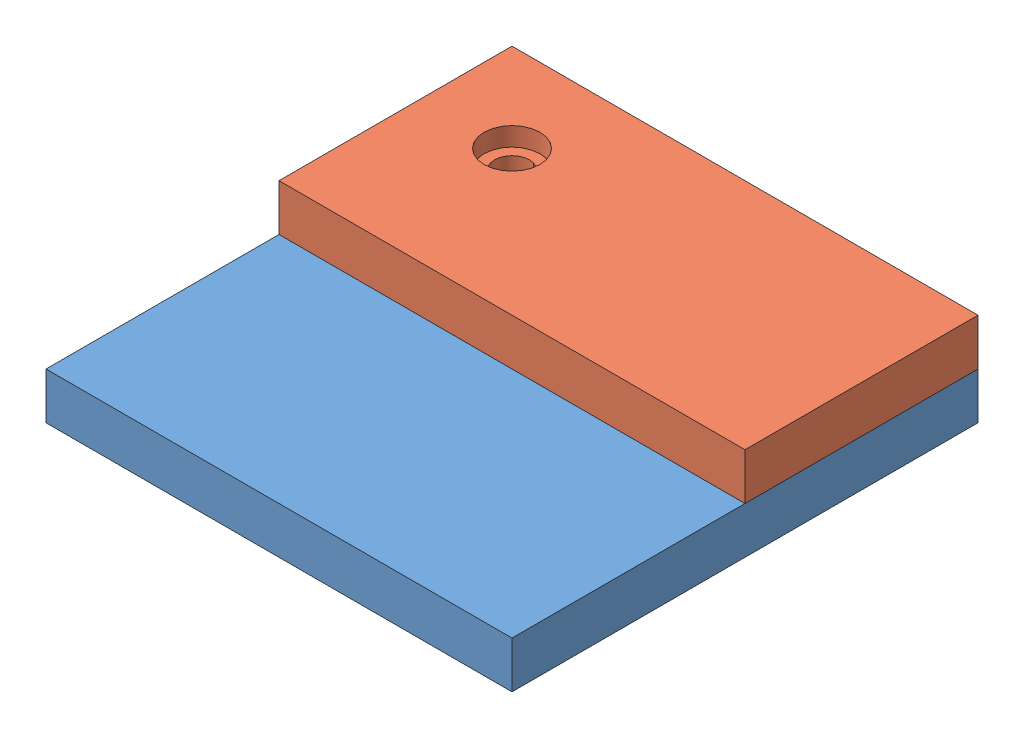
SolidWorks assembly Assembly of 2 plates.SLDASM, configuration Default (file format 7000). Lengths in mm.
Overall size (100 20 100).
2 component instances, 2 part files, 3 mates.
Components (placement in the parent):
- Plate1-1: Plate1.SLDPRT [Default] at (-125.8475 27.1781 68.1624) size (100 10 100)
- Plate2-1: Plate2.SLDPRT [Default] at (-125.8475 37.1781 18.1624) size (100 10 50)
Mates (geometry in assembly coordinates):
- Coincident1: coincident aligned: plane of Plate1-1 through (-125.8475 37.1781 -31.8376) normal (0 0 -1); plane of Plate2-1 through (-125.8475 47.1781 -31.8376) normal (0 0 -1)
- Coincident2: coincident aligned: plane of Plate1-1 through (-25.8475 37.1781 68.1624) normal (1 0 0); plane of Plate2-1 through (-25.8475 47.1781 18.1624) normal (1 0 0)
- Coincident3: coincident anti-aligned: plane of Plate1-1 through (-125.8475 37.1781 -31.8376) normal (0 1 0); plane of Plate2-1 through (-125.8475 37.1781 -31.8376) normal (0 -1 0)
